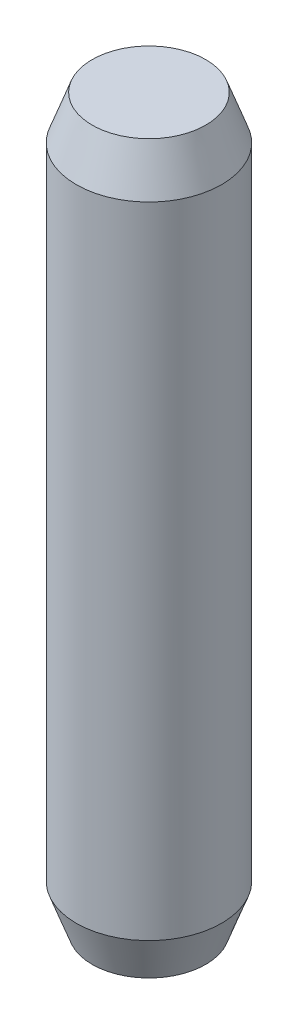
ISO-10303-21;
HEADER;
FILE_DESCRIPTION(('STEP AP214'),'2;1');
FILE_NAME('part.step','',(''),(''),'','','');
FILE_SCHEMA(('AUTOMOTIVE_DESIGN { 1 0 10303 214 1 1 1 1 }'));
ENDSEC;
DATA;
#1=APPLICATION_CONTEXT('core data for automotive mechanical design processes');
#2=APPLICATION_PROTOCOL_DEFINITION('international standard','automotive_design',2000,#1);
#3=PRODUCT_CONTEXT('',#1,'mechanical');
#4=PRODUCT('Part','Part','',(#3));
#5=PRODUCT_RELATED_PRODUCT_CATEGORY('part','',(#4));
#6=PRODUCT_DEFINITION_FORMATION('','',#4);
#7=PRODUCT_DEFINITION_CONTEXT('part definition',#1,'design');
#8=PRODUCT_DEFINITION('design','',#6,#7);
#9=PRODUCT_DEFINITION_SHAPE('','',#8);
#10=(LENGTH_UNIT() NAMED_UNIT(*) SI_UNIT(.MILLI.,.METRE.));
#11=(NAMED_UNIT(*) PLANE_ANGLE_UNIT() SI_UNIT($,.RADIAN.));
#12=(NAMED_UNIT(*) SI_UNIT($,.STERADIAN.) SOLID_ANGLE_UNIT());
#13=UNCERTAINTY_MEASURE_WITH_UNIT(LENGTH_MEASURE(1.E-05),#10,'distance_accuracy_value','');
#14=(GEOMETRIC_REPRESENTATION_CONTEXT(3) GLOBAL_UNCERTAINTY_ASSIGNED_CONTEXT((#13)) GLOBAL_UNIT_ASSIGNED_CONTEXT((#10,
#11,#12)) REPRESENTATION_CONTEXT('',''));
#15=CARTESIAN_POINT('',(0.,0.,0.));
#16=DIRECTION('',(0.,0.,1.));
#17=DIRECTION('',(1.,0.,0.));
#18=AXIS2_PLACEMENT_3D('',#15,#16,#17);
#19=CARTESIAN_POINT('',(0.,20.,0.));
#20=DIRECTION('',(0.,1.,0.));
#21=DIRECTION('',(0.,0.,1.));
#22=AXIS2_PLACEMENT_3D('',#19,#20,#21);
#23=PLANE('',#22);
#24=CARTESIAN_POINT('',(0.,19.9999999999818,0.));
#25=DIRECTION('',(0.,-1.,0.));
#26=DIRECTION('',(0.,0.,-1.));
#27=AXIS2_PLACEMENT_3D('',#24,#25,#26);
#28=CIRCLE('',#27,1.56323571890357);
#29=CARTESIAN_POINT('',(0.,19.9999999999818,-1.56323571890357));
#30=VERTEX_POINT('',#29);
#31=EDGE_CURVE('E17',#30,#30,#28,.T.);
#32=ORIENTED_EDGE('',*,*,#31,.F.);
#33=EDGE_LOOP('',(#32));
#34=FACE_BOUND('',#33,.T.);
#35=ADVANCED_FACE('F14',(#34),#23,.T.);
#36=CARTESIAN_POINT('',(0.,0.,0.));
#37=DIRECTION('',(0.,1.,0.));
#38=DIRECTION('',(0.,0.,1.));
#39=AXIS2_PLACEMENT_3D('',#36,#37,#38);
#40=PLANE('',#39);
#41=CARTESIAN_POINT('',(0.,-5.6843418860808E-11,0.));
#42=DIRECTION('',(0.,1.,0.));
#43=DIRECTION('',(0.,0.,1.));
#44=AXIS2_PLACEMENT_3D('',#41,#42,#43);
#45=CIRCLE('',#44,1.56323571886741);
#46=CARTESIAN_POINT('',(0.,-5.6843418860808E-11,1.56323571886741));
#47=VERTEX_POINT('',#46);
#48=EDGE_CURVE('E26',#47,#47,#45,.T.);
#49=ORIENTED_EDGE('',*,*,#48,.F.);
#50=EDGE_LOOP('',(#49));
#51=FACE_BOUND('',#50,.T.);
#52=ADVANCED_FACE('F37',(#51),#40,.F.);
#53=CARTESIAN_POINT('',(0.,18.8000000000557,0.));
#54=DIRECTION('',(0.,-1.,0.));
#55=DIRECTION('',(0.,0.,-1.));
#56=AXIS2_PLACEMENT_3D('',#53,#54,#55);
#57=CONICAL_SURFACE('',#56,2.00000000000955,0.349065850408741);
#58=CARTESIAN_POINT('',(0.,18.8,0.));
#59=DIRECTION('',(0.,1.,0.));
#60=DIRECTION('',(0.,0.,1.));
#61=AXIS2_PLACEMENT_3D('',#58,#59,#60);
#62=CIRCLE('',#61,2.);
#63=CARTESIAN_POINT('',(0.,18.8,2.));
#64=VERTEX_POINT('',#63);
#65=EDGE_CURVE('E21',#64,#64,#62,.F.);
#66=ORIENTED_EDGE('',*,*,#65,.F.);
#67=EDGE_LOOP('',(#66));
#68=FACE_BOUND('',#67,.T.);
#69=ORIENTED_EDGE('',*,*,#31,.T.);
#70=EDGE_LOOP('',(#69));
#71=FACE_BOUND('',#70,.T.);
#72=ADVANCED_FACE('F34',(#68,#71),#57,.T.);
#73=CARTESIAN_POINT('',(0.,1.19999999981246,0.));
#74=DIRECTION('',(0.,1.,0.));
#75=DIRECTION('',(0.,0.,1.));
#76=AXIS2_PLACEMENT_3D('',#73,#74,#75);
#77=CONICAL_SURFACE('',#76,1.99999999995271,0.349065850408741);
#78=ORIENTED_EDGE('',*,*,#48,.T.);
#79=EDGE_LOOP('',(#78));
#80=FACE_BOUND('',#79,.T.);
#81=CARTESIAN_POINT('',(0.,1.2,0.));
#82=DIRECTION('',(0.,1.,0.));
#83=DIRECTION('',(0.,0.,1.));
#84=AXIS2_PLACEMENT_3D('',#81,#82,#83);
#85=CIRCLE('',#84,2.);
#86=CARTESIAN_POINT('',(0.,1.2,2.));
#87=VERTEX_POINT('',#86);
#88=EDGE_CURVE('E10',#87,#87,#85,.T.);
#89=ORIENTED_EDGE('',*,*,#88,.F.);
#90=EDGE_LOOP('',(#89));
#91=FACE_BOUND('',#90,.T.);
#92=ADVANCED_FACE('F45',(#80,#91),#77,.T.);
#93=CARTESIAN_POINT('',(0.,-1.,0.));
#94=DIRECTION('',(0.,1.,0.));
#95=DIRECTION('',(0.,0.,1.));
#96=AXIS2_PLACEMENT_3D('',#93,#94,#95);
#97=CYLINDRICAL_SURFACE('',#96,2.);
#98=ORIENTED_EDGE('',*,*,#88,.T.);
#99=EDGE_LOOP('',(#98));
#100=FACE_BOUND('',#99,.T.);
#101=ORIENTED_EDGE('',*,*,#65,.T.);
#102=EDGE_LOOP('',(#101));
#103=FACE_BOUND('',#102,.T.);
#104=ADVANCED_FACE('F43',(#100,#103),#97,.T.);
#105=CLOSED_SHELL('',(#35,#52,#72,#92,#104));
#106=MANIFOLD_SOLID_BREP('B1',#105);
#107=ADVANCED_BREP_SHAPE_REPRESENTATION('',(#18,#106),#14);
#108=SHAPE_DEFINITION_REPRESENTATION(#9,#107);
ENDSEC;
END-ISO-10303-21;
